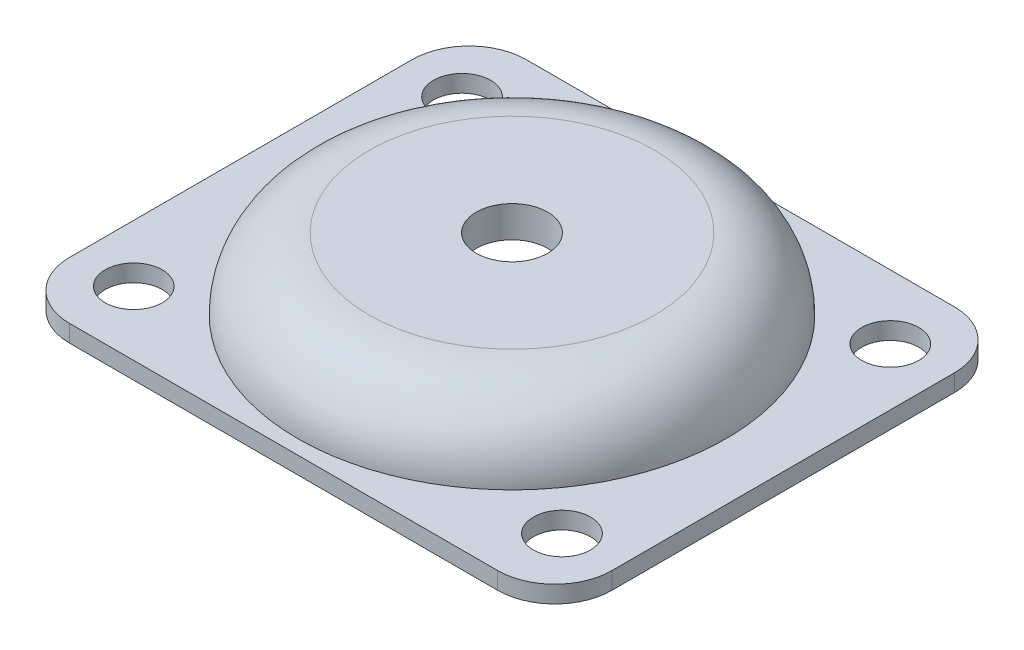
ISO-10303-21;
HEADER;
FILE_DESCRIPTION(('STEP AP214'),'2;1');
FILE_NAME('part.step','',(''),(''),'','','');
FILE_SCHEMA(('AUTOMOTIVE_DESIGN { 1 0 10303 214 1 1 1 1 }'));
ENDSEC;
DATA;
#1=APPLICATION_CONTEXT('core data for automotive mechanical design processes');
#2=APPLICATION_PROTOCOL_DEFINITION('international standard','automotive_design',2000,#1);
#3=PRODUCT_CONTEXT('',#1,'mechanical');
#4=PRODUCT('Part','Part','',(#3));
#5=PRODUCT_RELATED_PRODUCT_CATEGORY('part','',(#4));
#6=PRODUCT_DEFINITION_FORMATION('','',#4);
#7=PRODUCT_DEFINITION_CONTEXT('part definition',#1,'design');
#8=PRODUCT_DEFINITION('design','',#6,#7);
#9=PRODUCT_DEFINITION_SHAPE('','',#8);
#10=(LENGTH_UNIT() NAMED_UNIT(*) SI_UNIT(.MILLI.,.METRE.));
#11=(NAMED_UNIT(*) PLANE_ANGLE_UNIT() SI_UNIT($,.RADIAN.));
#12=(NAMED_UNIT(*) SI_UNIT($,.STERADIAN.) SOLID_ANGLE_UNIT());
#13=UNCERTAINTY_MEASURE_WITH_UNIT(LENGTH_MEASURE(1.E-05),#10,'distance_accuracy_value','');
#14=(GEOMETRIC_REPRESENTATION_CONTEXT(3) GLOBAL_UNCERTAINTY_ASSIGNED_CONTEXT((#13)) GLOBAL_UNIT_ASSIGNED_CONTEXT((#10,
#11,#12)) REPRESENTATION_CONTEXT('',''));
#15=CARTESIAN_POINT('',(0.,0.,0.));
#16=DIRECTION('',(0.,0.,1.));
#17=DIRECTION('',(1.,0.,0.));
#18=AXIS2_PLACEMENT_3D('',#15,#16,#17);
#19=CARTESIAN_POINT('',(19.,1.2,-16.));
#20=DIRECTION('',(-1.,0.,0.));
#21=DIRECTION('',(0.,0.,1.));
#22=AXIS2_PLACEMENT_3D('',#19,#20,#21);
#23=PLANE('',#22);
#24=DIRECTION('',(0.,0.,-1.));
#25=VECTOR('',#24,1.);
#26=CARTESIAN_POINT('',(19.,0.,-16.));
#27=LINE('',#26,#25);
#28=CARTESIAN_POINT('',(19.,0.,12.));
#29=VERTEX_POINT('',#28);
#30=CARTESIAN_POINT('',(19.,0.,-12.));
#31=VERTEX_POINT('',#30);
#32=EDGE_CURVE('E184',#29,#31,#27,.T.);
#33=ORIENTED_EDGE('',*,*,#32,.T.);
#34=DIRECTION('',(0.,-1.,0.));
#35=VECTOR('',#34,1.);
#36=CARTESIAN_POINT('',(19.,1.2,-12.));
#37=LINE('',#36,#35);
#38=CARTESIAN_POINT('',(19.,1.2,-12.));
#39=VERTEX_POINT('',#38);
#40=EDGE_CURVE('E13',#31,#39,#37,.F.);
#41=ORIENTED_EDGE('',*,*,#40,.T.);
#42=DIRECTION('',(0.,0.,-1.));
#43=VECTOR('',#42,1.);
#44=CARTESIAN_POINT('',(19.,1.2,-16.));
#45=LINE('',#44,#43);
#46=CARTESIAN_POINT('',(19.,1.2,12.));
#47=VERTEX_POINT('',#46);
#48=EDGE_CURVE('E140',#47,#39,#45,.T.);
#49=ORIENTED_EDGE('',*,*,#48,.F.);
#50=DIRECTION('',(0.,-1.,0.));
#51=VECTOR('',#50,1.);
#52=CARTESIAN_POINT('',(19.,1.2,12.));
#53=LINE('',#52,#51);
#54=EDGE_CURVE('E56',#47,#29,#53,.T.);
#55=ORIENTED_EDGE('',*,*,#54,.T.);
#56=EDGE_LOOP('',(#33,#41,#49,#55));
#57=FACE_BOUND('',#56,.T.);
#58=ADVANCED_FACE('F48',(#57),#23,.F.);
#59=CARTESIAN_POINT('',(-19.,1.2,-16.));
#60=DIRECTION('',(0.,0.,1.));
#61=DIRECTION('',(1.,0.,0.));
#62=AXIS2_PLACEMENT_3D('',#59,#60,#61);
#63=PLANE('',#62);
#64=DIRECTION('',(-1.,0.,0.));
#65=VECTOR('',#64,1.);
#66=CARTESIAN_POINT('',(-19.,0.,-16.));
#67=LINE('',#66,#65);
#68=CARTESIAN_POINT('',(15.,0.,-16.));
#69=VERTEX_POINT('',#68);
#70=CARTESIAN_POINT('',(-15.,0.,-16.));
#71=VERTEX_POINT('',#70);
#72=EDGE_CURVE('E145',#69,#71,#67,.T.);
#73=ORIENTED_EDGE('',*,*,#72,.T.);
#74=DIRECTION('',(0.,-1.,0.));
#75=VECTOR('',#74,1.);
#76=CARTESIAN_POINT('',(-15.,1.2,-16.));
#77=LINE('',#76,#75);
#78=CARTESIAN_POINT('',(-15.,1.2,-16.));
#79=VERTEX_POINT('',#78);
#80=EDGE_CURVE('E63',#71,#79,#77,.F.);
#81=ORIENTED_EDGE('',*,*,#80,.T.);
#82=DIRECTION('',(-1.,0.,0.));
#83=VECTOR('',#82,1.);
#84=CARTESIAN_POINT('',(-19.,1.2,-16.));
#85=LINE('',#84,#83);
#86=CARTESIAN_POINT('',(15.,1.2,-16.));
#87=VERTEX_POINT('',#86);
#88=EDGE_CURVE('E143',#87,#79,#85,.T.);
#89=ORIENTED_EDGE('',*,*,#88,.F.);
#90=DIRECTION('',(0.,-1.,0.));
#91=VECTOR('',#90,1.);
#92=CARTESIAN_POINT('',(15.,1.2,-16.));
#93=LINE('',#92,#91);
#94=EDGE_CURVE('E176',#87,#69,#93,.T.);
#95=ORIENTED_EDGE('',*,*,#94,.T.);
#96=EDGE_LOOP('',(#73,#81,#89,#95));
#97=FACE_BOUND('',#96,.T.);
#98=ADVANCED_FACE('F249',(#97),#63,.F.);
#99=CARTESIAN_POINT('',(-19.,1.2,-16.));
#100=DIRECTION('',(1.,0.,0.));
#101=DIRECTION('',(0.,0.,-1.));
#102=AXIS2_PLACEMENT_3D('',#99,#100,#101);
#103=PLANE('',#102);
#104=DIRECTION('',(0.,0.,1.));
#105=VECTOR('',#104,1.);
#106=CARTESIAN_POINT('',(-19.,0.,-16.));
#107=LINE('',#106,#105);
#108=CARTESIAN_POINT('',(-19.,0.,-12.));
#109=VERTEX_POINT('',#108);
#110=CARTESIAN_POINT('',(-19.,0.,12.));
#111=VERTEX_POINT('',#110);
#112=EDGE_CURVE('E141',#109,#111,#107,.T.);
#113=ORIENTED_EDGE('',*,*,#112,.T.);
#114=DIRECTION('',(0.,-1.,0.));
#115=VECTOR('',#114,1.);
#116=CARTESIAN_POINT('',(-19.,1.2,12.));
#117=LINE('',#116,#115);
#118=CARTESIAN_POINT('',(-19.,1.2,12.));
#119=VERTEX_POINT('',#118);
#120=EDGE_CURVE('E119',#111,#119,#117,.F.);
#121=ORIENTED_EDGE('',*,*,#120,.T.);
#122=DIRECTION('',(0.,0.,1.));
#123=VECTOR('',#122,1.);
#124=CARTESIAN_POINT('',(-19.,1.2,-16.));
#125=LINE('',#124,#123);
#126=CARTESIAN_POINT('',(-19.,1.2,-12.));
#127=VERTEX_POINT('',#126);
#128=EDGE_CURVE('E196',#127,#119,#125,.T.);
#129=ORIENTED_EDGE('',*,*,#128,.F.);
#130=DIRECTION('',(0.,-1.,0.));
#131=VECTOR('',#130,1.);
#132=CARTESIAN_POINT('',(-19.,1.2,-12.));
#133=LINE('',#132,#131);
#134=EDGE_CURVE('E124',#127,#109,#133,.T.);
#135=ORIENTED_EDGE('',*,*,#134,.T.);
#136=EDGE_LOOP('',(#113,#121,#129,#135));
#137=FACE_BOUND('',#136,.T.);
#138=ADVANCED_FACE('F253',(#137),#103,.F.);
#139=CARTESIAN_POINT('',(-19.,1.2,16.));
#140=DIRECTION('',(0.,0.,-1.));
#141=DIRECTION('',(-1.,0.,0.));
#142=AXIS2_PLACEMENT_3D('',#139,#140,#141);
#143=PLANE('',#142);
#144=DIRECTION('',(1.,0.,0.));
#145=VECTOR('',#144,1.);
#146=CARTESIAN_POINT('',(-19.,1.2,16.));
#147=LINE('',#146,#145);
#148=CARTESIAN_POINT('',(-15.,1.2,16.));
#149=VERTEX_POINT('',#148);
#150=CARTESIAN_POINT('',(15.,1.2,16.));
#151=VERTEX_POINT('',#150);
#152=EDGE_CURVE('E134',#149,#151,#147,.T.);
#153=ORIENTED_EDGE('',*,*,#152,.F.);
#154=DIRECTION('',(0.,-1.,0.));
#155=VECTOR('',#154,1.);
#156=CARTESIAN_POINT('',(-15.,1.2,16.));
#157=LINE('',#156,#155);
#158=CARTESIAN_POINT('',(-15.,0.,16.));
#159=VERTEX_POINT('',#158);
#160=EDGE_CURVE('E118',#149,#159,#157,.T.);
#161=ORIENTED_EDGE('',*,*,#160,.T.);
#162=DIRECTION('',(1.,0.,0.));
#163=VECTOR('',#162,1.);
#164=CARTESIAN_POINT('',(-19.,0.,16.));
#165=LINE('',#164,#163);
#166=CARTESIAN_POINT('',(15.,0.,16.));
#167=VERTEX_POINT('',#166);
#168=EDGE_CURVE('E131',#159,#167,#165,.T.);
#169=ORIENTED_EDGE('',*,*,#168,.T.);
#170=DIRECTION('',(0.,-1.,0.));
#171=VECTOR('',#170,1.);
#172=CARTESIAN_POINT('',(15.,1.2,16.));
#173=LINE('',#172,#171);
#174=EDGE_CURVE('E136',#167,#151,#173,.F.);
#175=ORIENTED_EDGE('',*,*,#174,.T.);
#176=EDGE_LOOP('',(#153,#161,#169,#175));
#177=FACE_BOUND('',#176,.T.);
#178=ADVANCED_FACE('F130',(#177),#143,.F.);
#179=CARTESIAN_POINT('',(0.,1.2,0.));
#180=DIRECTION('',(0.,1.,0.));
#181=DIRECTION('',(0.,0.,1.));
#182=AXIS2_PLACEMENT_3D('',#179,#180,#181);
#183=PLANE('',#182);
#184=CARTESIAN_POINT('',(-15.,1.2,11.5));
#185=DIRECTION('',(0.,1.,0.));
#186=DIRECTION('',(0.,0.,-1.));
#187=AXIS2_PLACEMENT_3D('',#184,#185,#186);
#188=CIRCLE('',#187,2.);
#189=CARTESIAN_POINT('',(-15.,1.2,9.5));
#190=VERTEX_POINT('',#189);
#191=EDGE_CURVE('E209',#190,#190,#188,.T.);
#192=ORIENTED_EDGE('',*,*,#191,.F.);
#193=EDGE_LOOP('',(#192));
#194=FACE_BOUND('',#193,.T.);
#195=CARTESIAN_POINT('',(15.,1.2,11.5));
#196=DIRECTION('',(0.,1.,0.));
#197=DIRECTION('',(0.,0.,-1.));
#198=AXIS2_PLACEMENT_3D('',#195,#196,#197);
#199=CIRCLE('',#198,2.);
#200=CARTESIAN_POINT('',(15.,1.2,9.5));
#201=VERTEX_POINT('',#200);
#202=EDGE_CURVE('E208',#201,#201,#199,.T.);
#203=ORIENTED_EDGE('',*,*,#202,.F.);
#204=EDGE_LOOP('',(#203));
#205=FACE_BOUND('',#204,.T.);
#206=CARTESIAN_POINT('',(15.,1.2,-11.5));
#207=DIRECTION('',(0.,1.,0.));
#208=DIRECTION('',(0.,0.,1.));
#209=AXIS2_PLACEMENT_3D('',#206,#207,#208);
#210=CIRCLE('',#209,2.);
#211=CARTESIAN_POINT('',(15.,1.2,-9.5));
#212=VERTEX_POINT('',#211);
#213=EDGE_CURVE('E215',#212,#212,#210,.T.);
#214=ORIENTED_EDGE('',*,*,#213,.F.);
#215=EDGE_LOOP('',(#214));
#216=FACE_BOUND('',#215,.T.);
#217=CARTESIAN_POINT('',(-15.,1.2,-11.5));
#218=DIRECTION('',(0.,1.,0.));
#219=DIRECTION('',(0.,0.,1.));
#220=AXIS2_PLACEMENT_3D('',#217,#218,#219);
#221=CIRCLE('',#220,2.);
#222=CARTESIAN_POINT('',(-15.,1.2,-9.5));
#223=VERTEX_POINT('',#222);
#224=EDGE_CURVE('E192',#223,#223,#221,.T.);
#225=ORIENTED_EDGE('',*,*,#224,.F.);
#226=EDGE_LOOP('',(#225));
#227=FACE_BOUND('',#226,.T.);
#228=CARTESIAN_POINT('',(0.,1.2,0.));
#229=DIRECTION('',(0.,1.,0.));
#230=DIRECTION('',(0.,0.,1.));
#231=AXIS2_PLACEMENT_3D('',#228,#229,#230);
#232=CIRCLE('',#231,15.);
#233=CARTESIAN_POINT('',(0.,1.2,15.));
#234=VERTEX_POINT('',#233);
#235=EDGE_CURVE('E153',#234,#234,#232,.T.);
#236=ORIENTED_EDGE('',*,*,#235,.F.);
#237=EDGE_LOOP('',(#236));
#238=FACE_BOUND('',#237,.T.);
#239=ORIENTED_EDGE('',*,*,#128,.T.);
#240=CARTESIAN_POINT('',(-15.,1.2,12.));
#241=DIRECTION('',(0.,1.,0.));
#242=DIRECTION('',(0.,0.,1.));
#243=AXIS2_PLACEMENT_3D('',#240,#241,#242);
#244=CIRCLE('',#243,4.);
#245=EDGE_CURVE('E174',#119,#149,#244,.T.);
#246=ORIENTED_EDGE('',*,*,#245,.T.);
#247=ORIENTED_EDGE('',*,*,#152,.T.);
#248=CARTESIAN_POINT('',(15.,1.2,12.));
#249=DIRECTION('',(0.,1.,0.));
#250=DIRECTION('',(0.,0.,1.));
#251=AXIS2_PLACEMENT_3D('',#248,#249,#250);
#252=CIRCLE('',#251,4.);
#253=EDGE_CURVE('E169',#151,#47,#252,.T.);
#254=ORIENTED_EDGE('',*,*,#253,.T.);
#255=ORIENTED_EDGE('',*,*,#48,.T.);
#256=CARTESIAN_POINT('',(15.,1.2,-12.));
#257=DIRECTION('',(0.,1.,0.));
#258=DIRECTION('',(0.,0.,1.));
#259=AXIS2_PLACEMENT_3D('',#256,#257,#258);
#260=CIRCLE('',#259,4.);
#261=EDGE_CURVE('E70',#39,#87,#260,.T.);
#262=ORIENTED_EDGE('',*,*,#261,.T.);
#263=ORIENTED_EDGE('',*,*,#88,.T.);
#264=CARTESIAN_POINT('',(-15.,1.2,-12.));
#265=DIRECTION('',(0.,1.,0.));
#266=DIRECTION('',(0.,0.,1.));
#267=AXIS2_PLACEMENT_3D('',#264,#265,#266);
#268=CIRCLE('',#267,4.);
#269=EDGE_CURVE('E172',#79,#127,#268,.T.);
#270=ORIENTED_EDGE('',*,*,#269,.T.);
#271=EDGE_LOOP('',(#239,#246,#247,#254,#255,#262,#263,#270));
#272=FACE_BOUND('',#271,.T.);
#273=ADVANCED_FACE('F261',(#194,#205,#216,#227,#238,#272),#183,.T.);
#274=CARTESIAN_POINT('',(0.,0.,0.));
#275=DIRECTION('',(0.,1.,0.));
#276=DIRECTION('',(0.,0.,1.));
#277=AXIS2_PLACEMENT_3D('',#274,#275,#276);
#278=PLANE('',#277);
#279=CARTESIAN_POINT('',(0.,0.,0.));
#280=DIRECTION('',(0.,-1.,0.));
#281=DIRECTION('',(0.,0.,-1.));
#282=AXIS2_PLACEMENT_3D('',#279,#280,#281);
#283=CIRCLE('',#282,14.);
#284=CARTESIAN_POINT('',(0.,0.,-14.));
#285=VERTEX_POINT('',#284);
#286=EDGE_CURVE('E159',#285,#285,#283,.T.);
#287=ORIENTED_EDGE('',*,*,#286,.F.);
#288=EDGE_LOOP('',(#287));
#289=FACE_BOUND('',#288,.T.);
#290=CARTESIAN_POINT('',(-15.,0.,11.5));
#291=DIRECTION('',(0.,1.,0.));
#292=DIRECTION('',(0.,0.,1.));
#293=AXIS2_PLACEMENT_3D('',#290,#291,#292);
#294=CIRCLE('',#293,2.);
#295=CARTESIAN_POINT('',(-15.,0.,13.5));
#296=VERTEX_POINT('',#295);
#297=EDGE_CURVE('E205',#296,#296,#294,.F.);
#298=ORIENTED_EDGE('',*,*,#297,.F.);
#299=EDGE_LOOP('',(#298));
#300=FACE_BOUND('',#299,.T.);
#301=CARTESIAN_POINT('',(15.,0.,11.5));
#302=DIRECTION('',(0.,1.,0.));
#303=DIRECTION('',(0.,0.,1.));
#304=AXIS2_PLACEMENT_3D('',#301,#302,#303);
#305=CIRCLE('',#304,2.);
#306=CARTESIAN_POINT('',(15.,0.,13.5));
#307=VERTEX_POINT('',#306);
#308=EDGE_CURVE('E212',#307,#307,#305,.F.);
#309=ORIENTED_EDGE('',*,*,#308,.F.);
#310=EDGE_LOOP('',(#309));
#311=FACE_BOUND('',#310,.T.);
#312=CARTESIAN_POINT('',(15.,0.,-11.5));
#313=DIRECTION('',(0.,1.,0.));
#314=DIRECTION('',(0.,0.,1.));
#315=AXIS2_PLACEMENT_3D('',#312,#313,#314);
#316=CIRCLE('',#315,2.);
#317=CARTESIAN_POINT('',(15.,0.,-9.5));
#318=VERTEX_POINT('',#317);
#319=EDGE_CURVE('E204',#318,#318,#316,.F.);
#320=ORIENTED_EDGE('',*,*,#319,.F.);
#321=EDGE_LOOP('',(#320));
#322=FACE_BOUND('',#321,.T.);
#323=CARTESIAN_POINT('',(-15.,0.,-11.5));
#324=DIRECTION('',(0.,1.,0.));
#325=DIRECTION('',(0.,0.,1.));
#326=AXIS2_PLACEMENT_3D('',#323,#324,#325);
#327=CIRCLE('',#326,2.);
#328=CARTESIAN_POINT('',(-15.,0.,-9.5));
#329=VERTEX_POINT('',#328);
#330=EDGE_CURVE('E189',#329,#329,#327,.F.);
#331=ORIENTED_EDGE('',*,*,#330,.F.);
#332=EDGE_LOOP('',(#331));
#333=FACE_BOUND('',#332,.T.);
#334=ORIENTED_EDGE('',*,*,#168,.F.);
#335=CARTESIAN_POINT('',(-15.,0.,12.));
#336=DIRECTION('',(0.,1.,0.));
#337=DIRECTION('',(0.,0.,1.));
#338=AXIS2_PLACEMENT_3D('',#335,#336,#337);
#339=CIRCLE('',#338,4.);
#340=EDGE_CURVE('E114',#159,#111,#339,.F.);
#341=ORIENTED_EDGE('',*,*,#340,.T.);
#342=ORIENTED_EDGE('',*,*,#112,.F.);
#343=CARTESIAN_POINT('',(-15.,0.,-12.));
#344=DIRECTION('',(0.,1.,0.));
#345=DIRECTION('',(0.,0.,1.));
#346=AXIS2_PLACEMENT_3D('',#343,#344,#345);
#347=CIRCLE('',#346,4.);
#348=EDGE_CURVE('E125',#109,#71,#347,.F.);
#349=ORIENTED_EDGE('',*,*,#348,.T.);
#350=ORIENTED_EDGE('',*,*,#72,.F.);
#351=CARTESIAN_POINT('',(15.,0.,-12.));
#352=DIRECTION('',(0.,1.,0.));
#353=DIRECTION('',(0.,0.,1.));
#354=AXIS2_PLACEMENT_3D('',#351,#352,#353);
#355=CIRCLE('',#354,4.);
#356=EDGE_CURVE('E163',#69,#31,#355,.F.);
#357=ORIENTED_EDGE('',*,*,#356,.T.);
#358=ORIENTED_EDGE('',*,*,#32,.F.);
#359=CARTESIAN_POINT('',(15.,0.,12.));
#360=DIRECTION('',(0.,1.,0.));
#361=DIRECTION('',(0.,0.,1.));
#362=AXIS2_PLACEMENT_3D('',#359,#360,#361);
#363=CIRCLE('',#362,4.);
#364=EDGE_CURVE('E135',#29,#167,#363,.F.);
#365=ORIENTED_EDGE('',*,*,#364,.T.);
#366=EDGE_LOOP('',(#334,#341,#342,#349,#350,#357,#358,#365));
#367=FACE_BOUND('',#366,.T.);
#368=ADVANCED_FACE('F138',(#289,#300,#311,#322,#333,#367),#278,.F.);
#369=CARTESIAN_POINT('',(0.,6.2,0.));
#370=DIRECTION('',(0.,1.,0.));
#371=DIRECTION('',(0.,0.,1.));
#372=AXIS2_PLACEMENT_3D('',#369,#370,#371);
#373=PLANE('',#372);
#374=CARTESIAN_POINT('',(0.,6.2,0.));
#375=DIRECTION('',(0.,1.,0.));
#376=DIRECTION('',(0.,0.,1.));
#377=AXIS2_PLACEMENT_3D('',#374,#375,#376);
#378=CIRCLE('',#377,2.5);
#379=CARTESIAN_POINT('',(0.,6.2,2.5));
#380=VERTEX_POINT('',#379);
#381=EDGE_CURVE('E160',#380,#380,#378,.T.);
#382=ORIENTED_EDGE('',*,*,#381,.F.);
#383=EDGE_LOOP('',(#382));
#384=FACE_BOUND('',#383,.T.);
#385=CARTESIAN_POINT('',(0.,6.2,0.));
#386=DIRECTION('',(0.,1.,0.));
#387=DIRECTION('',(0.,0.,1.));
#388=AXIS2_PLACEMENT_3D('',#385,#386,#387);
#389=CIRCLE('',#388,10.);
#390=CARTESIAN_POINT('',(0.,6.2,10.));
#391=VERTEX_POINT('',#390);
#392=EDGE_CURVE('E149',#391,#391,#389,.T.);
#393=ORIENTED_EDGE('',*,*,#392,.T.);
#394=EDGE_LOOP('',(#393));
#395=FACE_BOUND('',#394,.T.);
#396=ADVANCED_FACE('F229',(#384,#395),#373,.T.);
#397=CARTESIAN_POINT('',(0.,1.2,0.));
#398=DIRECTION('',(0.,1.,0.));
#399=DIRECTION('',(0.,0.,1.));
#400=AXIS2_PLACEMENT_3D('',#397,#398,#399);
#401=TOROIDAL_SURFACE('',#400,10.,5.);
#402=ORIENTED_EDGE('',*,*,#235,.T.);
#403=EDGE_LOOP('',(#402));
#404=FACE_BOUND('',#403,.T.);
#405=ORIENTED_EDGE('',*,*,#392,.F.);
#406=EDGE_LOOP('',(#405));
#407=FACE_BOUND('',#406,.T.);
#408=ADVANCED_FACE('F232',(#404,#407),#401,.T.);
#409=CARTESIAN_POINT('',(-15.,-0.000999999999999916,-11.5));
#410=DIRECTION('',(0.,1.,0.));
#411=DIRECTION('',(0.,0.,1.));
#412=AXIS2_PLACEMENT_3D('',#409,#410,#411);
#413=CYLINDRICAL_SURFACE('',#412,2.);
#414=ORIENTED_EDGE('',*,*,#224,.T.);
#415=EDGE_LOOP('',(#414));
#416=FACE_BOUND('',#415,.T.);
#417=ORIENTED_EDGE('',*,*,#330,.T.);
#418=EDGE_LOOP('',(#417));
#419=FACE_BOUND('',#418,.T.);
#420=ADVANCED_FACE('F237',(#416,#419),#413,.F.);
#421=CARTESIAN_POINT('',(15.,-0.000999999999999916,-11.5));
#422=DIRECTION('',(0.,1.,0.));
#423=DIRECTION('',(0.,0.,1.));
#424=AXIS2_PLACEMENT_3D('',#421,#422,#423);
#425=CYLINDRICAL_SURFACE('',#424,2.);
#426=ORIENTED_EDGE('',*,*,#213,.T.);
#427=EDGE_LOOP('',(#426));
#428=FACE_BOUND('',#427,.T.);
#429=ORIENTED_EDGE('',*,*,#319,.T.);
#430=EDGE_LOOP('',(#429));
#431=FACE_BOUND('',#430,.T.);
#432=ADVANCED_FACE('F243',(#428,#431),#425,.F.);
#433=CARTESIAN_POINT('',(15.,-0.000999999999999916,11.5));
#434=DIRECTION('',(0.,1.,0.));
#435=DIRECTION('',(0.,0.,1.));
#436=AXIS2_PLACEMENT_3D('',#433,#434,#435);
#437=CYLINDRICAL_SURFACE('',#436,2.);
#438=ORIENTED_EDGE('',*,*,#202,.T.);
#439=EDGE_LOOP('',(#438));
#440=FACE_BOUND('',#439,.T.);
#441=ORIENTED_EDGE('',*,*,#308,.T.);
#442=EDGE_LOOP('',(#441));
#443=FACE_BOUND('',#442,.T.);
#444=ADVANCED_FACE('F272',(#440,#443),#437,.F.);
#445=CARTESIAN_POINT('',(-15.,-0.000999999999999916,11.5));
#446=DIRECTION('',(0.,1.,0.));
#447=DIRECTION('',(0.,0.,1.));
#448=AXIS2_PLACEMENT_3D('',#445,#446,#447);
#449=CYLINDRICAL_SURFACE('',#448,2.);
#450=ORIENTED_EDGE('',*,*,#191,.T.);
#451=EDGE_LOOP('',(#450));
#452=FACE_BOUND('',#451,.T.);
#453=ORIENTED_EDGE('',*,*,#297,.T.);
#454=EDGE_LOOP('',(#453));
#455=FACE_BOUND('',#454,.T.);
#456=ADVANCED_FACE('F268',(#452,#455),#449,.F.);
#457=CARTESIAN_POINT('',(0.,4.,0.));
#458=DIRECTION('',(0.,-1.,0.));
#459=DIRECTION('',(0.,0.,-1.));
#460=AXIS2_PLACEMENT_3D('',#457,#458,#459);
#461=PLANE('',#460);
#462=CARTESIAN_POINT('',(0.,4.,0.));
#463=DIRECTION('',(0.,-1.,0.));
#464=DIRECTION('',(0.,0.,-1.));
#465=AXIS2_PLACEMENT_3D('',#462,#463,#464);
#466=CIRCLE('',#465,2.5);
#467=CARTESIAN_POINT('',(0.,4.,2.5));
#468=VERTEX_POINT('',#467);
#469=EDGE_CURVE('E156',#468,#468,#466,.T.);
#470=ORIENTED_EDGE('',*,*,#469,.F.);
#471=EDGE_LOOP('',(#470));
#472=FACE_BOUND('',#471,.T.);
#473=CARTESIAN_POINT('',(0.,4.,0.));
#474=DIRECTION('',(0.,-1.,0.));
#475=DIRECTION('',(0.,0.,-1.));
#476=AXIS2_PLACEMENT_3D('',#473,#474,#475);
#477=CIRCLE('',#476,10.);
#478=CARTESIAN_POINT('',(0.,4.,-10.));
#479=VERTEX_POINT('',#478);
#480=EDGE_CURVE('E152',#479,#479,#477,.T.);
#481=ORIENTED_EDGE('',*,*,#480,.T.);
#482=EDGE_LOOP('',(#481));
#483=FACE_BOUND('',#482,.T.);
#484=ADVANCED_FACE('F271',(#472,#483),#461,.T.);
#485=CARTESIAN_POINT('',(0.,0.,0.));
#486=DIRECTION('',(0.,-1.,0.));
#487=DIRECTION('',(0.,0.,-1.));
#488=AXIS2_PLACEMENT_3D('',#485,#486,#487);
#489=TOROIDAL_SURFACE('',#488,10.,4.);
#490=ORIENTED_EDGE('',*,*,#286,.T.);
#491=EDGE_LOOP('',(#490));
#492=FACE_BOUND('',#491,.T.);
#493=ORIENTED_EDGE('',*,*,#480,.F.);
#494=EDGE_LOOP('',(#493));
#495=FACE_BOUND('',#494,.T.);
#496=ADVANCED_FACE('F282',(#492,#495),#489,.F.);
#497=CARTESIAN_POINT('',(0.,0.,0.));
#498=DIRECTION('',(0.,1.,0.));
#499=DIRECTION('',(0.,0.,1.));
#500=AXIS2_PLACEMENT_3D('',#497,#498,#499);
#501=CYLINDRICAL_SURFACE('',#500,2.5);
#502=CARTESIAN_POINT('',(0.,4.,2.5));
#503=CARTESIAN_POINT('',(0.,4.02291666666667,2.5));
#504=CARTESIAN_POINT('',(0.,4.04583333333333,2.5));
#505=CARTESIAN_POINT('',(0.,4.09166666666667,2.5));
#506=CARTESIAN_POINT('',(0.,4.11458333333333,2.5));
#507=CARTESIAN_POINT('',(0.,4.16041666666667,2.5));
#508=CARTESIAN_POINT('',(0.,4.18333333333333,2.5));
#509=CARTESIAN_POINT('',(0.,4.22916666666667,2.5));
#510=CARTESIAN_POINT('',(0.,4.25208333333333,2.5));
#511=CARTESIAN_POINT('',(0.,4.29791666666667,2.5));
#512=CARTESIAN_POINT('',(0.,4.32083333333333,2.5));
#513=CARTESIAN_POINT('',(0.,4.36666666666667,2.5));
#514=CARTESIAN_POINT('',(0.,4.38958333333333,2.5));
#515=CARTESIAN_POINT('',(0.,4.43541666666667,2.5));
#516=CARTESIAN_POINT('',(0.,4.45833333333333,2.5));
#517=CARTESIAN_POINT('',(0.,4.50416666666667,2.5));
#518=CARTESIAN_POINT('',(0.,4.52708333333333,2.5));
#519=CARTESIAN_POINT('',(0.,4.57291666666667,2.5));
#520=CARTESIAN_POINT('',(0.,4.59583333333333,2.5));
#521=CARTESIAN_POINT('',(0.,4.64166666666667,2.5));
#522=CARTESIAN_POINT('',(0.,4.66458333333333,2.5));
#523=CARTESIAN_POINT('',(0.,4.71041666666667,2.5));
#524=CARTESIAN_POINT('',(0.,4.73333333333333,2.5));
#525=CARTESIAN_POINT('',(0.,4.77916666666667,2.5));
#526=CARTESIAN_POINT('',(0.,4.80208333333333,2.5));
#527=CARTESIAN_POINT('',(0.,4.84791666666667,2.5));
#528=CARTESIAN_POINT('',(0.,4.87083333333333,2.5));
#529=CARTESIAN_POINT('',(0.,4.91666666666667,2.5));
#530=CARTESIAN_POINT('',(0.,4.93958333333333,2.5));
#531=CARTESIAN_POINT('',(0.,4.98541666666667,2.5));
#532=CARTESIAN_POINT('',(0.,5.00833333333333,2.5));
#533=CARTESIAN_POINT('',(0.,5.05416666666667,2.5));
#534=CARTESIAN_POINT('',(0.,5.07708333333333,2.5));
#535=CARTESIAN_POINT('',(0.,5.12291666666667,2.5));
#536=CARTESIAN_POINT('',(0.,5.14583333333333,2.5));
#537=CARTESIAN_POINT('',(0.,5.19166666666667,2.5));
#538=CARTESIAN_POINT('',(0.,5.21458333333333,2.5));
#539=CARTESIAN_POINT('',(0.,5.26041666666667,2.5));
#540=CARTESIAN_POINT('',(0.,5.28333333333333,2.5));
#541=CARTESIAN_POINT('',(0.,5.32916666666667,2.5));
#542=CARTESIAN_POINT('',(0.,5.35208333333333,2.5));
#543=CARTESIAN_POINT('',(0.,5.39791666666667,2.5));
#544=CARTESIAN_POINT('',(0.,5.42083333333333,2.5));
#545=CARTESIAN_POINT('',(0.,5.46666666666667,2.5));
#546=CARTESIAN_POINT('',(0.,5.48958333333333,2.5));
#547=CARTESIAN_POINT('',(0.,5.53541666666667,2.5));
#548=CARTESIAN_POINT('',(0.,5.55833333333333,2.5));
#549=CARTESIAN_POINT('',(0.,5.60416666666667,2.5));
#550=CARTESIAN_POINT('',(0.,5.62708333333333,2.5));
#551=CARTESIAN_POINT('',(0.,5.67291666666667,2.5));
#552=CARTESIAN_POINT('',(0.,5.69583333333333,2.5));
#553=CARTESIAN_POINT('',(0.,5.74166666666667,2.5));
#554=CARTESIAN_POINT('',(0.,5.76458333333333,2.5));
#555=CARTESIAN_POINT('',(0.,5.81041666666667,2.5));
#556=CARTESIAN_POINT('',(0.,5.83333333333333,2.5));
#557=CARTESIAN_POINT('',(0.,5.87916666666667,2.5));
#558=CARTESIAN_POINT('',(0.,5.90208333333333,2.5));
#559=CARTESIAN_POINT('',(0.,5.94791666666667,2.5));
#560=CARTESIAN_POINT('',(0.,5.97083333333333,2.5));
#561=CARTESIAN_POINT('',(0.,6.01666666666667,2.5));
#562=CARTESIAN_POINT('',(0.,6.03958333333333,2.5));
#563=CARTESIAN_POINT('',(0.,6.08541666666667,2.5));
#564=CARTESIAN_POINT('',(0.,6.10833333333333,2.5));
#565=CARTESIAN_POINT('',(0.,6.15416666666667,2.5));
#566=CARTESIAN_POINT('',(0.,6.17708333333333,2.5));
#567=CARTESIAN_POINT('',(0.,6.2,2.5));
#568=B_SPLINE_CURVE_WITH_KNOTS('',3,(#502,#503,#504,#505,#506,#507,#508,#509,#510,#511,#512,
#513,#514,#515,#516,#517,#518,#519,#520,#521,#522,#523,#524,#525,#526,#527,#528,#529,#530,#531,
#532,#533,#534,#535,#536,#537,#538,#539,#540,#541,#542,#543,#544,#545,#546,#547,#548,#549,#550,
#551,#552,#553,#554,#555,#556,#557,#558,#559,#560,#561,#562,#563,#564,#565,#566,#567),
.UNSPECIFIED.,.F.,.F.,(4,2,2,2,2,2,2,2,2,2,2,2,2,2,2,2,2,2,2,2,2,2,2,2,2,2,2,2,2,2,2,2,4),(0.,
0.0687500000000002,0.1375,0.20625,0.275,0.343749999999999,0.4125,0.48125,0.55,0.618749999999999,
0.6875,0.75625,0.824999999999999,0.89375,0.9625,1.03125,1.1,1.16875,1.2375,1.30625,1.375,
1.44375,1.5125,1.58125,1.65,1.71875,1.7875,1.85625,1.925,1.99375,2.0625,2.13125,2.2),.UNSPECIFIED.);
#569=EDGE_CURVE('BSEAM227',#468,#380,#568,.T.);
#570=ORIENTED_EDGE('',*,*,#469,.T.);
#571=ORIENTED_EDGE('',*,*,#381,.T.);
#572=ORIENTED_EDGE('',*,*,#569,.T.);
#573=ORIENTED_EDGE('',*,*,#569,.F.);
#574=EDGE_LOOP('',(#570,#572,#571,#573));
#575=FACE_BOUND('',#574,.T.);
#576=ADVANCED_FACE('F227',(#575),#501,.F.);
#577=CARTESIAN_POINT('',(-15.,1.2,12.));
#578=DIRECTION('',(0.,-1.,0.));
#579=DIRECTION('',(0.,0.,-1.));
#580=AXIS2_PLACEMENT_3D('',#577,#578,#579);
#581=CYLINDRICAL_SURFACE('',#580,4.);
#582=ORIENTED_EDGE('',*,*,#245,.F.);
#583=ORIENTED_EDGE('',*,*,#120,.F.);
#584=ORIENTED_EDGE('',*,*,#340,.F.);
#585=ORIENTED_EDGE('',*,*,#160,.F.);
#586=EDGE_LOOP('',(#582,#583,#584,#585));
#587=FACE_BOUND('',#586,.T.);
#588=ADVANCED_FACE('F117',(#587),#581,.T.);
#589=CARTESIAN_POINT('',(-15.,1.2,-12.));
#590=DIRECTION('',(0.,-1.,0.));
#591=DIRECTION('',(0.,0.,-1.));
#592=AXIS2_PLACEMENT_3D('',#589,#590,#591);
#593=CYLINDRICAL_SURFACE('',#592,4.);
#594=ORIENTED_EDGE('',*,*,#269,.F.);
#595=ORIENTED_EDGE('',*,*,#80,.F.);
#596=ORIENTED_EDGE('',*,*,#348,.F.);
#597=ORIENTED_EDGE('',*,*,#134,.F.);
#598=EDGE_LOOP('',(#594,#595,#596,#597));
#599=FACE_BOUND('',#598,.T.);
#600=ADVANCED_FACE('F290',(#599),#593,.T.);
#601=CARTESIAN_POINT('',(15.,1.2,-12.));
#602=DIRECTION('',(0.,-1.,0.));
#603=DIRECTION('',(0.,0.,-1.));
#604=AXIS2_PLACEMENT_3D('',#601,#602,#603);
#605=CYLINDRICAL_SURFACE('',#604,4.);
#606=ORIENTED_EDGE('',*,*,#261,.F.);
#607=ORIENTED_EDGE('',*,*,#40,.F.);
#608=ORIENTED_EDGE('',*,*,#356,.F.);
#609=ORIENTED_EDGE('',*,*,#94,.F.);
#610=EDGE_LOOP('',(#606,#607,#608,#609));
#611=FACE_BOUND('',#610,.T.);
#612=ADVANCED_FACE('F301',(#611),#605,.T.);
#613=CARTESIAN_POINT('',(15.,1.2,12.));
#614=DIRECTION('',(0.,-1.,0.));
#615=DIRECTION('',(0.,0.,-1.));
#616=AXIS2_PLACEMENT_3D('',#613,#614,#615);
#617=CYLINDRICAL_SURFACE('',#616,4.);
#618=ORIENTED_EDGE('',*,*,#253,.F.);
#619=ORIENTED_EDGE('',*,*,#174,.F.);
#620=ORIENTED_EDGE('',*,*,#364,.F.);
#621=ORIENTED_EDGE('',*,*,#54,.F.);
#622=EDGE_LOOP('',(#618,#619,#620,#621));
#623=FACE_BOUND('',#622,.T.);
#624=ADVANCED_FACE('F50',(#623),#617,.T.);
#625=CLOSED_SHELL('',(#58,#98,#138,#178,#273,#368,#396,#408,#420,#432,#444,#456,#484,#496,#576,
#588,#600,#612,#624));
#626=MANIFOLD_SOLID_BREP('B2',#625);
#627=ADVANCED_BREP_SHAPE_REPRESENTATION('',(#18,#626),#14);
#628=SHAPE_DEFINITION_REPRESENTATION(#9,#627);
ENDSEC;
END-ISO-10303-21;
